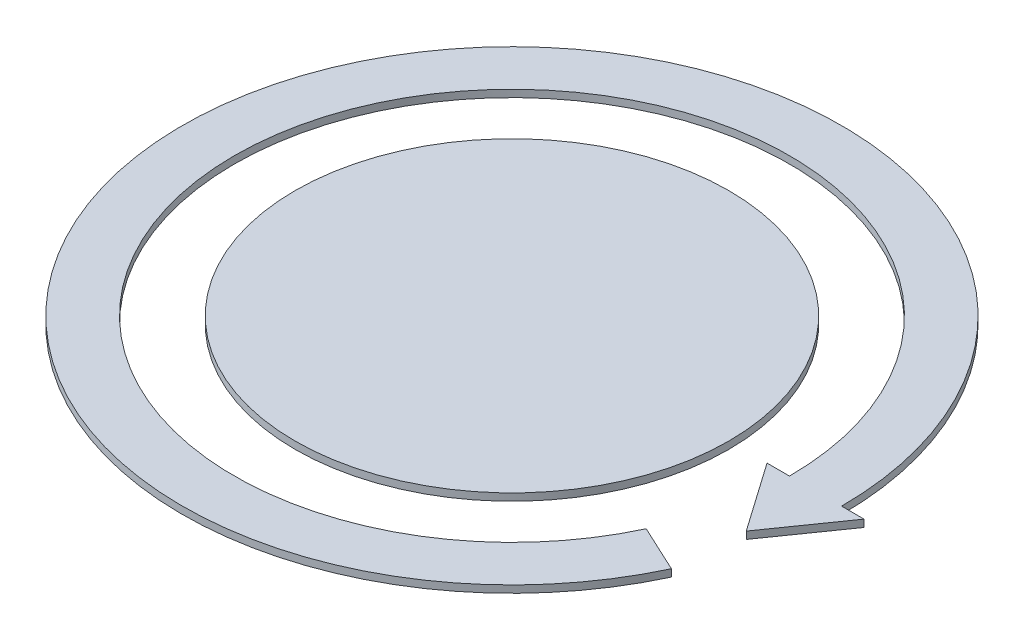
from build123d import *

# Parameters (mm, degrees)
SKIZZE1_R                         = 59.75
AUFSATZ_LINEAR_AUSTRAGEN1_DEPTH   = 2
AUFSATZ_LINEAR_AUSTRAGEN1_2_DEPTH = 2


with BuildPart() as part:
    # Skizze1 → Aufsatz-Linear austragen1 (new body)
    with BuildSketch(Plane(origin=(0, 0, 0), x_dir=(1, 0, 0), z_dir=(0, 1, 0))):
        with Locations(Location((0, 0, 0), (0, 0, 270))):
            Circle(SKIZZE1_R)
    extrude(amount=AUFSATZ_LINEAR_AUSTRAGEN1_DEPTH)


with BuildPart() as body_2:
    # Skizze1 → Aufsatz-Linear austragen1 2 (new body)
    with BuildSketch(Plane(origin=(0, 0, 0), x_dir=(1, 0, 0), z_dir=(0, 1, 0))):
        with BuildLine():
            Line((82.292747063, -38.373738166), (69.287230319, -32.30916611))
            ThreePointArc((69.287230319, -32.30916611), (-74.637829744, 16.546808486), (76.45, 0))
            Line((76.45, 0), (70.265590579, 0))
            Line((70.265590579, 0), (83.625, -19.079213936))
            Line((83.625, -19.079213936), (96.984409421, 0))
            Line((96.984409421, 0), (90.8, 0))
            ThreePointArc((90.8, 0), (-88.647677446, 19.652716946), (82.292747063, -38.373738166))
        make_face()
    extrude(amount=AUFSATZ_LINEAR_AUSTRAGEN1_2_DEPTH)


solid = Compound([part.part, body_2.part])
